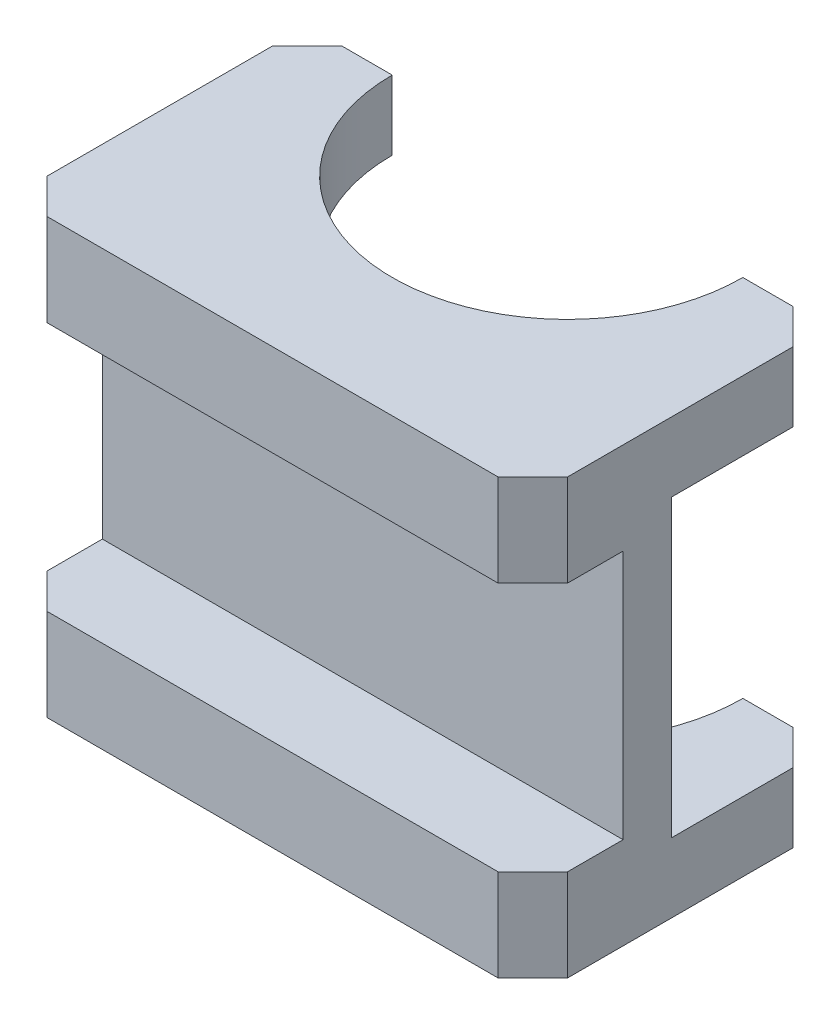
ISO-10303-21;
HEADER;
FILE_DESCRIPTION(('STEP AP214'),'2;1');
FILE_NAME('part.step','',(''),(''),'','','');
FILE_SCHEMA(('AUTOMOTIVE_DESIGN { 1 0 10303 214 1 1 1 1 }'));
ENDSEC;
DATA;
#1=APPLICATION_CONTEXT('core data for automotive mechanical design processes');
#2=APPLICATION_PROTOCOL_DEFINITION('international standard','automotive_design',2000,#1);
#3=PRODUCT_CONTEXT('',#1,'mechanical');
#4=PRODUCT('Part','Part','',(#3));
#5=PRODUCT_RELATED_PRODUCT_CATEGORY('part','',(#4));
#6=PRODUCT_DEFINITION_FORMATION('','',#4);
#7=PRODUCT_DEFINITION_CONTEXT('part definition',#1,'design');
#8=PRODUCT_DEFINITION('design','',#6,#7);
#9=PRODUCT_DEFINITION_SHAPE('','',#8);
#10=(LENGTH_UNIT() NAMED_UNIT(*) SI_UNIT(.MILLI.,.METRE.));
#11=(NAMED_UNIT(*) PLANE_ANGLE_UNIT() SI_UNIT($,.RADIAN.));
#12=(NAMED_UNIT(*) SI_UNIT($,.STERADIAN.) SOLID_ANGLE_UNIT());
#13=UNCERTAINTY_MEASURE_WITH_UNIT(LENGTH_MEASURE(1.E-05),#10,'distance_accuracy_value','');
#14=(GEOMETRIC_REPRESENTATION_CONTEXT(3) GLOBAL_UNCERTAINTY_ASSIGNED_CONTEXT((#13)) GLOBAL_UNIT_ASSIGNED_CONTEXT((#10,
#11,#12)) REPRESENTATION_CONTEXT('',''));
#15=CARTESIAN_POINT('',(0.,0.,0.));
#16=DIRECTION('',(0.,0.,1.));
#17=DIRECTION('',(1.,0.,0.));
#18=AXIS2_PLACEMENT_3D('',#15,#16,#17);
#19=CARTESIAN_POINT('',(31.877,31.75,-21.59));
#20=DIRECTION('',(0.,0.,1.));
#21=DIRECTION('',(1.,0.,0.));
#22=AXIS2_PLACEMENT_3D('',#19,#20,#21);
#23=PLANE('',#22);
#24=DIRECTION('',(1.,0.,0.));
#25=VECTOR('',#24,1.);
#26=CARTESIAN_POINT('',(0.,5.08,-21.59));
#27=LINE('',#26,#25);
#28=CARTESIAN_POINT('',(31.877,5.08,-21.59));
#29=VERTEX_POINT('',#28);
#30=CARTESIAN_POINT('',(35.56,5.08,-21.59));
#31=VERTEX_POINT('',#30);
#32=EDGE_CURVE('E247',#29,#31,#27,.T.);
#33=ORIENTED_EDGE('',*,*,#32,.T.);
#34=DIRECTION('',(0.,-1.,0.));
#35=VECTOR('',#34,1.);
#36=CARTESIAN_POINT('',(35.56,31.75,-21.59));
#37=LINE('',#36,#35);
#38=CARTESIAN_POINT('',(35.56,0.,-21.59));
#39=VERTEX_POINT('',#38);
#40=EDGE_CURVE('E394',#31,#39,#37,.T.);
#41=ORIENTED_EDGE('',*,*,#40,.T.);
#42=DIRECTION('',(-1.,0.,0.));
#43=VECTOR('',#42,1.);
#44=CARTESIAN_POINT('',(31.877,0.,-21.59));
#45=LINE('',#44,#43);
#46=CARTESIAN_POINT('',(31.877,0.,-21.59));
#47=VERTEX_POINT('',#46);
#48=EDGE_CURVE('E296',#39,#47,#45,.T.);
#49=ORIENTED_EDGE('',*,*,#48,.T.);
#50=DIRECTION('',(0.,-1.,0.));
#51=VECTOR('',#50,1.);
#52=CARTESIAN_POINT('',(31.877,31.75,-21.59));
#53=LINE('',#52,#51);
#54=EDGE_CURVE('E324',#29,#47,#53,.T.);
#55=ORIENTED_EDGE('',*,*,#54,.F.);
#56=EDGE_LOOP('',(#33,#41,#49,#55));
#57=FACE_BOUND('',#56,.T.);
#58=ADVANCED_FACE('F36',(#57),#23,.F.);
#59=CARTESIAN_POINT('',(0.,31.75,-21.59));
#60=DIRECTION('',(0.,0.,1.));
#61=DIRECTION('',(1.,0.,0.));
#62=AXIS2_PLACEMENT_3D('',#59,#60,#61);
#63=PLANE('',#62);
#64=DIRECTION('',(-1.,0.,0.));
#65=VECTOR('',#64,1.);
#66=CARTESIAN_POINT('',(0.,0.,-21.59));
#67=LINE('',#66,#65);
#68=CARTESIAN_POINT('',(6.223,0.,-21.59));
#69=VERTEX_POINT('',#68);
#70=CARTESIAN_POINT('',(2.54000000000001,0.,-21.59));
#71=VERTEX_POINT('',#70);
#72=EDGE_CURVE('E301',#69,#71,#67,.T.);
#73=ORIENTED_EDGE('',*,*,#72,.T.);
#74=DIRECTION('',(0.,1.,0.));
#75=VECTOR('',#74,1.);
#76=CARTESIAN_POINT('',(2.54000000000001,31.75,-21.59));
#77=LINE('',#76,#75);
#78=CARTESIAN_POINT('',(2.54000000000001,5.08,-21.59));
#79=VERTEX_POINT('',#78);
#80=EDGE_CURVE('E390',#71,#79,#77,.T.);
#81=ORIENTED_EDGE('',*,*,#80,.T.);
#82=CARTESIAN_POINT('',(6.223,5.08,-21.59));
#83=VERTEX_POINT('',#82);
#84=EDGE_CURVE('E244',#79,#83,#27,.T.);
#85=ORIENTED_EDGE('',*,*,#84,.T.);
#86=DIRECTION('',(0.,-1.,0.));
#87=VECTOR('',#86,1.);
#88=CARTESIAN_POINT('',(6.223,31.75,-21.59));
#89=LINE('',#88,#87);
#90=EDGE_CURVE('E320',#83,#69,#89,.T.);
#91=ORIENTED_EDGE('',*,*,#90,.T.);
#92=EDGE_LOOP('',(#73,#81,#85,#91));
#93=FACE_BOUND('',#92,.T.);
#94=ADVANCED_FACE('F469',(#93),#63,.F.);
#95=CARTESIAN_POINT('',(0.,31.75,0.));
#96=DIRECTION('',(0.,0.,-1.));
#97=DIRECTION('',(-1.,0.,0.));
#98=AXIS2_PLACEMENT_3D('',#95,#96,#97);
#99=PLANE('',#98);
#100=DIRECTION('',(1.,0.,0.));
#101=VECTOR('',#100,1.);
#102=CARTESIAN_POINT('',(0.,31.75,0.));
#103=LINE('',#102,#101);
#104=CARTESIAN_POINT('',(2.54,31.75,0.));
#105=VERTEX_POINT('',#104);
#106=CARTESIAN_POINT('',(35.56,31.75,0.));
#107=VERTEX_POINT('',#106);
#108=EDGE_CURVE('E307',#105,#107,#103,.T.);
#109=ORIENTED_EDGE('',*,*,#108,.F.);
#110=DIRECTION('',(0.,-1.,0.));
#111=VECTOR('',#110,1.);
#112=CARTESIAN_POINT('',(2.53999999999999,31.75,0.));
#113=LINE('',#112,#111);
#114=CARTESIAN_POINT('',(2.53999999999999,25.019,0.));
#115=VERTEX_POINT('',#114);
#116=EDGE_CURVE('E371',#105,#115,#113,.T.);
#117=ORIENTED_EDGE('',*,*,#116,.T.);
#118=DIRECTION('',(1.,0.,0.));
#119=VECTOR('',#118,1.);
#120=CARTESIAN_POINT('',(0.,25.019,0.));
#121=LINE('',#120,#119);
#122=CARTESIAN_POINT('',(35.56,25.019,0.));
#123=VERTEX_POINT('',#122);
#124=EDGE_CURVE('E277',#115,#123,#121,.T.);
#125=ORIENTED_EDGE('',*,*,#124,.T.);
#126=DIRECTION('',(0.,1.,0.));
#127=VECTOR('',#126,1.);
#128=CARTESIAN_POINT('',(35.56,31.75,0.));
#129=LINE('',#128,#127);
#130=EDGE_CURVE('E369',#123,#107,#129,.T.);
#131=ORIENTED_EDGE('',*,*,#130,.T.);
#132=EDGE_LOOP('',(#109,#117,#125,#131));
#133=FACE_BOUND('',#132,.T.);
#134=ADVANCED_FACE('F426',(#133),#99,.F.);
#135=CARTESIAN_POINT('',(0.,31.75,0.));
#136=DIRECTION('',(1.,0.,0.));
#137=DIRECTION('',(0.,0.,-1.));
#138=AXIS2_PLACEMENT_3D('',#135,#136,#137);
#139=PLANE('',#138);
#140=DIRECTION('',(0.,0.,1.));
#141=VECTOR('',#140,1.);
#142=CARTESIAN_POINT('',(0.,0.,0.));
#143=LINE('',#142,#141);
#144=CARTESIAN_POINT('',(0.,0.,-19.05));
#145=VERTEX_POINT('',#144);
#146=CARTESIAN_POINT('',(0.,0.,-2.53999999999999));
#147=VERTEX_POINT('',#146);
#148=EDGE_CURVE('E280',#145,#147,#143,.T.);
#149=ORIENTED_EDGE('',*,*,#148,.T.);
#150=DIRECTION('',(0.,1.,0.));
#151=VECTOR('',#150,1.);
#152=CARTESIAN_POINT('',(0.,31.75,-2.53999999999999));
#153=LINE('',#152,#151);
#154=CARTESIAN_POINT('',(0.,6.731,-2.53999999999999));
#155=VERTEX_POINT('',#154);
#156=EDGE_CURVE('E367',#147,#155,#153,.T.);
#157=ORIENTED_EDGE('',*,*,#156,.T.);
#158=DIRECTION('',(0.,0.,-1.));
#159=VECTOR('',#158,1.);
#160=CARTESIAN_POINT('',(0.,6.731,0.));
#161=LINE('',#160,#159);
#162=CARTESIAN_POINT('',(0.,6.731,-6.604));
#163=VERTEX_POINT('',#162);
#164=EDGE_CURVE('E268',#155,#163,#161,.T.);
#165=ORIENTED_EDGE('',*,*,#164,.T.);
#166=DIRECTION('',(0.,1.,0.));
#167=VECTOR('',#166,1.);
#168=CARTESIAN_POINT('',(0.,25.019,-6.60399999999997));
#169=LINE('',#168,#167);
#170=CARTESIAN_POINT('',(0.,25.019,-6.60399999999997));
#171=VERTEX_POINT('',#170);
#172=EDGE_CURVE('E270',#163,#171,#169,.T.);
#173=ORIENTED_EDGE('',*,*,#172,.T.);
#174=DIRECTION('',(0.,0.,1.));
#175=VECTOR('',#174,1.);
#176=CARTESIAN_POINT('',(0.,25.019,0.));
#177=LINE('',#176,#175);
#178=CARTESIAN_POINT('',(0.,25.019,-2.54000000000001));
#179=VERTEX_POINT('',#178);
#180=EDGE_CURVE('E273',#171,#179,#177,.T.);
#181=ORIENTED_EDGE('',*,*,#180,.T.);
#182=DIRECTION('',(0.,1.,0.));
#183=VECTOR('',#182,1.);
#184=CARTESIAN_POINT('',(0.,31.75,-2.54000000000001));
#185=LINE('',#184,#183);
#186=CARTESIAN_POINT('',(0.,31.75,-2.54000000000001));
#187=VERTEX_POINT('',#186);
#188=EDGE_CURVE('E365',#179,#187,#185,.T.);
#189=ORIENTED_EDGE('',*,*,#188,.T.);
#190=DIRECTION('',(0.,0.,1.));
#191=VECTOR('',#190,1.);
#192=CARTESIAN_POINT('',(0.,31.75,0.));
#193=LINE('',#192,#191);
#194=CARTESIAN_POINT('',(0.,31.75,-19.05));
#195=VERTEX_POINT('',#194);
#196=EDGE_CURVE('E304',#195,#187,#193,.T.);
#197=ORIENTED_EDGE('',*,*,#196,.F.);
#198=DIRECTION('',(0.,-1.,0.));
#199=VECTOR('',#198,1.);
#200=CARTESIAN_POINT('',(0.,31.75,-19.05));
#201=LINE('',#200,#199);
#202=CARTESIAN_POINT('',(0.,26.67,-19.05));
#203=VERTEX_POINT('',#202);
#204=EDGE_CURVE('E362',#195,#203,#201,.T.);
#205=ORIENTED_EDGE('',*,*,#204,.T.);
#206=DIRECTION('',(0.,0.,1.));
#207=VECTOR('',#206,1.);
#208=CARTESIAN_POINT('',(0.,26.67,-21.59));
#209=LINE('',#208,#207);
#210=CARTESIAN_POINT('',(0.,26.67,-10.1344380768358));
#211=VERTEX_POINT('',#210);
#212=EDGE_CURVE('E233',#203,#211,#209,.T.);
#213=ORIENTED_EDGE('',*,*,#212,.T.);
#214=DIRECTION('',(0.,-1.,0.));
#215=VECTOR('',#214,1.);
#216=CARTESIAN_POINT('',(0.,5.08,-10.1344380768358));
#217=LINE('',#216,#215);
#218=CARTESIAN_POINT('',(0.,5.08,-10.1344380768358));
#219=VERTEX_POINT('',#218);
#220=EDGE_CURVE('E237',#211,#219,#217,.T.);
#221=ORIENTED_EDGE('',*,*,#220,.T.);
#222=DIRECTION('',(0.,0.,-1.));
#223=VECTOR('',#222,1.);
#224=CARTESIAN_POINT('',(0.,5.08,-21.59));
#225=LINE('',#224,#223);
#226=CARTESIAN_POINT('',(0.,5.08,-19.05));
#227=VERTEX_POINT('',#226);
#228=EDGE_CURVE('E240',#219,#227,#225,.T.);
#229=ORIENTED_EDGE('',*,*,#228,.T.);
#230=DIRECTION('',(0.,-1.,0.));
#231=VECTOR('',#230,1.);
#232=CARTESIAN_POINT('',(0.,31.75,-19.05));
#233=LINE('',#232,#231);
#234=EDGE_CURVE('E359',#227,#145,#233,.T.);
#235=ORIENTED_EDGE('',*,*,#234,.T.);
#236=EDGE_LOOP('',(#149,#157,#165,#173,#181,#189,#197,#205,#213,#221,#229,#235));
#237=FACE_BOUND('',#236,.T.);
#238=ADVANCED_FACE('F38',(#237),#139,.F.);
#239=DIRECTION('',(1.,0.,0.));
#240=VECTOR('',#239,1.);
#241=CARTESIAN_POINT('',(0.,0.,0.));
#242=LINE('',#241,#240);
#243=CARTESIAN_POINT('',(2.54000000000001,0.,0.));
#244=VERTEX_POINT('',#243);
#245=CARTESIAN_POINT('',(35.56,0.,0.));
#246=VERTEX_POINT('',#245);
#247=EDGE_CURVE('E290',#244,#246,#242,.T.);
#248=ORIENTED_EDGE('',*,*,#247,.T.);
#249=DIRECTION('',(0.,1.,0.));
#250=VECTOR('',#249,1.);
#251=CARTESIAN_POINT('',(35.56,31.75,0.));
#252=LINE('',#251,#250);
#253=CARTESIAN_POINT('',(35.56,6.731,0.));
#254=VERTEX_POINT('',#253);
#255=EDGE_CURVE('E353',#246,#254,#252,.T.);
#256=ORIENTED_EDGE('',*,*,#255,.T.);
#257=DIRECTION('',(1.,0.,0.));
#258=VECTOR('',#257,1.);
#259=CARTESIAN_POINT('',(0.,6.731,0.));
#260=LINE('',#259,#258);
#261=CARTESIAN_POINT('',(2.54000000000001,6.731,0.));
#262=VERTEX_POINT('',#261);
#263=EDGE_CURVE('E276',#262,#254,#260,.T.);
#264=ORIENTED_EDGE('',*,*,#263,.F.);
#265=DIRECTION('',(0.,-1.,0.));
#266=VECTOR('',#265,1.);
#267=CARTESIAN_POINT('',(2.54000000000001,31.75,0.));
#268=LINE('',#267,#266);
#269=EDGE_CURVE('E350',#262,#244,#268,.T.);
#270=ORIENTED_EDGE('',*,*,#269,.T.);
#271=EDGE_LOOP('',(#248,#256,#264,#270));
#272=FACE_BOUND('',#271,.T.);
#273=ADVANCED_FACE('F452',(#272),#99,.F.);
#274=CARTESIAN_POINT('',(38.1,31.75,0.));
#275=DIRECTION('',(-1.,0.,0.));
#276=DIRECTION('',(0.,0.,1.));
#277=AXIS2_PLACEMENT_3D('',#274,#275,#276);
#278=PLANE('',#277);
#279=DIRECTION('',(0.,0.,-1.));
#280=VECTOR('',#279,1.);
#281=CARTESIAN_POINT('',(38.1,6.731,0.));
#282=LINE('',#281,#280);
#283=CARTESIAN_POINT('',(38.1,6.731,-2.54000000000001));
#284=VERTEX_POINT('',#283);
#285=CARTESIAN_POINT('',(38.1,6.731,-6.604));
#286=VERTEX_POINT('',#285);
#287=EDGE_CURVE('E260',#284,#286,#282,.T.);
#288=ORIENTED_EDGE('',*,*,#287,.F.);
#289=DIRECTION('',(0.,-1.,0.));
#290=VECTOR('',#289,1.);
#291=CARTESIAN_POINT('',(38.1,31.75,-2.54000000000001));
#292=LINE('',#291,#290);
#293=CARTESIAN_POINT('',(38.1,0.,-2.54000000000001));
#294=VERTEX_POINT('',#293);
#295=EDGE_CURVE('E339',#284,#294,#292,.T.);
#296=ORIENTED_EDGE('',*,*,#295,.T.);
#297=DIRECTION('',(0.,0.,-1.));
#298=VECTOR('',#297,1.);
#299=CARTESIAN_POINT('',(38.1,0.,0.));
#300=LINE('',#299,#298);
#301=CARTESIAN_POINT('',(38.1,0.,-19.05));
#302=VERTEX_POINT('',#301);
#303=EDGE_CURVE('E293',#294,#302,#300,.T.);
#304=ORIENTED_EDGE('',*,*,#303,.T.);
#305=DIRECTION('',(0.,1.,0.));
#306=VECTOR('',#305,1.);
#307=CARTESIAN_POINT('',(38.1,31.75,-19.05));
#308=LINE('',#307,#306);
#309=CARTESIAN_POINT('',(38.1,5.08,-19.05));
#310=VERTEX_POINT('',#309);
#311=EDGE_CURVE('E334',#302,#310,#308,.T.);
#312=ORIENTED_EDGE('',*,*,#311,.T.);
#313=DIRECTION('',(0.,0.,-1.));
#314=VECTOR('',#313,1.);
#315=CARTESIAN_POINT('',(38.1,5.08,-21.59));
#316=LINE('',#315,#314);
#317=CARTESIAN_POINT('',(38.1,5.08,-10.1344380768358));
#318=VERTEX_POINT('',#317);
#319=EDGE_CURVE('E231',#318,#310,#316,.T.);
#320=ORIENTED_EDGE('',*,*,#319,.F.);
#321=DIRECTION('',(0.,-1.,0.));
#322=VECTOR('',#321,1.);
#323=CARTESIAN_POINT('',(38.1,5.08,-10.1344380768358));
#324=LINE('',#323,#322);
#325=CARTESIAN_POINT('',(38.1,26.67,-10.1344380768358));
#326=VERTEX_POINT('',#325);
#327=EDGE_CURVE('E216',#326,#318,#324,.T.);
#328=ORIENTED_EDGE('',*,*,#327,.F.);
#329=DIRECTION('',(0.,0.,1.));
#330=VECTOR('',#329,1.);
#331=CARTESIAN_POINT('',(38.1,26.67,-21.59));
#332=LINE('',#331,#330);
#333=CARTESIAN_POINT('',(38.1,26.67,-19.05));
#334=VERTEX_POINT('',#333);
#335=EDGE_CURVE('E208',#334,#326,#332,.T.);
#336=ORIENTED_EDGE('',*,*,#335,.F.);
#337=DIRECTION('',(0.,1.,0.));
#338=VECTOR('',#337,1.);
#339=CARTESIAN_POINT('',(38.1,31.75,-19.05));
#340=LINE('',#339,#338);
#341=CARTESIAN_POINT('',(38.1,31.75,-19.05));
#342=VERTEX_POINT('',#341);
#343=EDGE_CURVE('E332',#334,#342,#340,.T.);
#344=ORIENTED_EDGE('',*,*,#343,.T.);
#345=DIRECTION('',(0.,0.,-1.));
#346=VECTOR('',#345,1.);
#347=CARTESIAN_POINT('',(38.1,31.75,0.));
#348=LINE('',#347,#346);
#349=CARTESIAN_POINT('',(38.1,31.75,-2.53999999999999));
#350=VERTEX_POINT('',#349);
#351=EDGE_CURVE('E310',#350,#342,#348,.T.);
#352=ORIENTED_EDGE('',*,*,#351,.F.);
#353=DIRECTION('',(0.,-1.,0.));
#354=VECTOR('',#353,1.);
#355=CARTESIAN_POINT('',(38.1,31.75,-2.53999999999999));
#356=LINE('',#355,#354);
#357=CARTESIAN_POINT('',(38.1,25.019,-2.53999999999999));
#358=VERTEX_POINT('',#357);
#359=EDGE_CURVE('E336',#350,#358,#356,.T.);
#360=ORIENTED_EDGE('',*,*,#359,.T.);
#361=DIRECTION('',(0.,0.,1.));
#362=VECTOR('',#361,1.);
#363=CARTESIAN_POINT('',(38.1,25.019,0.));
#364=LINE('',#363,#362);
#365=CARTESIAN_POINT('',(38.1,25.019,-6.60399999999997));
#366=VERTEX_POINT('',#365);
#367=EDGE_CURVE('E265',#366,#358,#364,.T.);
#368=ORIENTED_EDGE('',*,*,#367,.F.);
#369=DIRECTION('',(0.,1.,0.));
#370=VECTOR('',#369,1.);
#371=CARTESIAN_POINT('',(38.1,25.019,-6.60399999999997));
#372=LINE('',#371,#370);
#373=EDGE_CURVE('E262',#286,#366,#372,.T.);
#374=ORIENTED_EDGE('',*,*,#373,.F.);
#375=EDGE_LOOP('',(#288,#296,#304,#312,#320,#328,#336,#344,#352,#360,#368,#374));
#376=FACE_BOUND('',#375,.T.);
#377=ADVANCED_FACE('F230',(#376),#278,.F.);
#378=DIRECTION('',(-1.,0.,0.));
#379=VECTOR('',#378,1.);
#380=CARTESIAN_POINT('',(31.877,31.75,-21.59));
#381=LINE('',#380,#379);
#382=CARTESIAN_POINT('',(35.56,31.75,-21.59));
#383=VERTEX_POINT('',#382);
#384=CARTESIAN_POINT('',(31.877,31.75,-21.59));
#385=VERTEX_POINT('',#384);
#386=EDGE_CURVE('E313',#383,#385,#381,.T.);
#387=ORIENTED_EDGE('',*,*,#386,.F.);
#388=DIRECTION('',(0.,-1.,0.));
#389=VECTOR('',#388,1.);
#390=CARTESIAN_POINT('',(35.56,31.75,-21.59));
#391=LINE('',#390,#389);
#392=CARTESIAN_POINT('',(35.56,26.67,-21.59));
#393=VERTEX_POINT('',#392);
#394=EDGE_CURVE('E44',#383,#393,#391,.T.);
#395=ORIENTED_EDGE('',*,*,#394,.T.);
#396=DIRECTION('',(1.,0.,0.));
#397=VECTOR('',#396,1.);
#398=CARTESIAN_POINT('',(0.,26.67,-21.59));
#399=LINE('',#398,#397);
#400=CARTESIAN_POINT('',(31.877,26.67,-21.59));
#401=VERTEX_POINT('',#400);
#402=EDGE_CURVE('E243',#401,#393,#399,.T.);
#403=ORIENTED_EDGE('',*,*,#402,.F.);
#404=EDGE_CURVE('E325',#385,#401,#53,.T.);
#405=ORIENTED_EDGE('',*,*,#404,.F.);
#406=EDGE_LOOP('',(#387,#395,#403,#405));
#407=FACE_BOUND('',#406,.T.);
#408=ADVANCED_FACE('F400',(#407),#23,.F.);
#409=CARTESIAN_POINT('',(19.05,31.75,-21.59));
#410=DIRECTION('',(0.,-1.,0.));
#411=DIRECTION('',(0.,0.,-1.));
#412=AXIS2_PLACEMENT_3D('',#409,#410,#411);
#413=CYLINDRICAL_SURFACE('',#412,12.827);
#414=ORIENTED_EDGE('',*,*,#90,.F.);
#415=CARTESIAN_POINT('',(19.05,5.08,-21.59));
#416=DIRECTION('',(0.,-1.,0.));
#417=DIRECTION('',(0.,0.,-1.));
#418=AXIS2_PLACEMENT_3D('',#415,#416,#417);
#419=CIRCLE('',#418,12.827);
#420=CARTESIAN_POINT('',(13.2792088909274,5.08,-10.1344380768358));
#421=VERTEX_POINT('',#420);
#422=EDGE_CURVE('E259',#83,#421,#419,.F.);
#423=ORIENTED_EDGE('',*,*,#422,.T.);
#424=DIRECTION('',(0.,-1.,0.));
#425=VECTOR('',#424,1.);
#426=CARTESIAN_POINT('',(13.2792088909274,31.75,-10.1344380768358));
#427=LINE('',#426,#425);
#428=CARTESIAN_POINT('',(13.2792088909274,26.67,-10.1344380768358));
#429=VERTEX_POINT('',#428);
#430=EDGE_CURVE('E329',#421,#429,#427,.F.);
#431=ORIENTED_EDGE('',*,*,#430,.T.);
#432=CARTESIAN_POINT('',(19.05,26.67,-21.59));
#433=DIRECTION('',(0.,1.,0.));
#434=DIRECTION('',(0.,0.,1.));
#435=AXIS2_PLACEMENT_3D('',#432,#433,#434);
#436=CIRCLE('',#435,12.827);
#437=CARTESIAN_POINT('',(6.223,26.67,-21.59));
#438=VERTEX_POINT('',#437);
#439=EDGE_CURVE('E255',#429,#438,#436,.F.);
#440=ORIENTED_EDGE('',*,*,#439,.T.);
#441=CARTESIAN_POINT('',(6.223,31.75,-21.59));
#442=VERTEX_POINT('',#441);
#443=EDGE_CURVE('E321',#442,#438,#89,.T.);
#444=ORIENTED_EDGE('',*,*,#443,.F.);
#445=CARTESIAN_POINT('',(19.05,31.75,-21.59));
#446=DIRECTION('',(0.,-1.,0.));
#447=DIRECTION('',(0.,0.,1.));
#448=AXIS2_PLACEMENT_3D('',#445,#446,#447);
#449=CIRCLE('',#448,12.827);
#450=EDGE_CURVE('E315',#385,#442,#449,.T.);
#451=ORIENTED_EDGE('',*,*,#450,.F.);
#452=ORIENTED_EDGE('',*,*,#404,.T.);
#453=CARTESIAN_POINT('',(24.8207911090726,26.67,-10.1344380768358));
#454=VERTEX_POINT('',#453);
#455=EDGE_CURVE('E246',#401,#454,#436,.F.);
#456=ORIENTED_EDGE('',*,*,#455,.T.);
#457=DIRECTION('',(0.,-1.,0.));
#458=VECTOR('',#457,1.);
#459=CARTESIAN_POINT('',(24.8207911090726,31.75,-10.1344380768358));
#460=LINE('',#459,#458);
#461=CARTESIAN_POINT('',(24.8207911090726,5.08,-10.1344380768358));
#462=VERTEX_POINT('',#461);
#463=EDGE_CURVE('E224',#454,#462,#460,.T.);
#464=ORIENTED_EDGE('',*,*,#463,.T.);
#465=EDGE_CURVE('E256',#462,#29,#419,.F.);
#466=ORIENTED_EDGE('',*,*,#465,.T.);
#467=ORIENTED_EDGE('',*,*,#54,.T.);
#468=CARTESIAN_POINT('',(19.05,0.,-21.59));
#469=DIRECTION('',(0.,-1.,0.));
#470=DIRECTION('',(0.,0.,1.));
#471=AXIS2_PLACEMENT_3D('',#468,#469,#470);
#472=CIRCLE('',#471,12.827);
#473=EDGE_CURVE('E298',#47,#69,#472,.T.);
#474=ORIENTED_EDGE('',*,*,#473,.T.);
#475=EDGE_LOOP('',(#414,#423,#431,#440,#444,#451,#452,#456,#464,#466,#467,#474));
#476=FACE_BOUND('',#475,.T.);
#477=ADVANCED_FACE('F405',(#476),#413,.F.);
#478=CARTESIAN_POINT('',(2.54000000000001,26.67,-21.59));
#479=VERTEX_POINT('',#478);
#480=EDGE_CURVE('E227',#479,#438,#399,.T.);
#481=ORIENTED_EDGE('',*,*,#480,.F.);
#482=DIRECTION('',(0.,1.,0.));
#483=VECTOR('',#482,1.);
#484=CARTESIAN_POINT('',(2.54000000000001,31.75,-21.59));
#485=LINE('',#484,#483);
#486=CARTESIAN_POINT('',(2.54,31.75,-21.59));
#487=VERTEX_POINT('',#486);
#488=EDGE_CURVE('E388',#479,#487,#485,.T.);
#489=ORIENTED_EDGE('',*,*,#488,.T.);
#490=DIRECTION('',(-1.,0.,0.));
#491=VECTOR('',#490,1.);
#492=CARTESIAN_POINT('',(0.,31.75,-21.59));
#493=LINE('',#492,#491);
#494=EDGE_CURVE('E317',#442,#487,#493,.T.);
#495=ORIENTED_EDGE('',*,*,#494,.F.);
#496=ORIENTED_EDGE('',*,*,#443,.T.);
#497=EDGE_LOOP('',(#481,#489,#495,#496));
#498=FACE_BOUND('',#497,.T.);
#499=ADVANCED_FACE('F502',(#498),#63,.F.);
#500=CARTESIAN_POINT('',(19.05,31.75,-21.59));
#501=DIRECTION('',(0.,1.,0.));
#502=DIRECTION('',(0.,0.,1.));
#503=AXIS2_PLACEMENT_3D('',#500,#501,#502);
#504=PLANE('',#503);
#505=ORIENTED_EDGE('',*,*,#196,.T.);
#506=DIRECTION('',(-0.707106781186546,0.,-0.707106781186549));
#507=VECTOR('',#506,1.);
#508=CARTESIAN_POINT('',(0.,31.75,-2.54000000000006));
#509=LINE('',#508,#507);
#510=EDGE_CURVE('E384',#187,#105,#509,.F.);
#511=ORIENTED_EDGE('',*,*,#510,.T.);
#512=ORIENTED_EDGE('',*,*,#108,.T.);
#513=DIRECTION('',(-0.707106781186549,0.,0.707106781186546));
#514=VECTOR('',#513,1.);
#515=CARTESIAN_POINT('',(38.1,31.75,-2.53999999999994));
#516=LINE('',#515,#514);
#517=EDGE_CURVE('E382',#107,#350,#516,.F.);
#518=ORIENTED_EDGE('',*,*,#517,.T.);
#519=ORIENTED_EDGE('',*,*,#351,.T.);
#520=DIRECTION('',(0.707106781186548,0.,0.707106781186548));
#521=VECTOR('',#520,1.);
#522=CARTESIAN_POINT('',(27.305,31.75,-29.845));
#523=LINE('',#522,#521);
#524=EDGE_CURVE('E378',#342,#383,#523,.F.);
#525=ORIENTED_EDGE('',*,*,#524,.T.);
#526=ORIENTED_EDGE('',*,*,#386,.T.);
#527=ORIENTED_EDGE('',*,*,#450,.T.);
#528=ORIENTED_EDGE('',*,*,#494,.T.);
#529=DIRECTION('',(0.70710678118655,0.,-0.707106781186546));
#530=VECTOR('',#529,1.);
#531=CARTESIAN_POINT('',(10.7950000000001,31.75,-29.845));
#532=LINE('',#531,#530);
#533=EDGE_CURVE('E380',#487,#195,#532,.F.);
#534=ORIENTED_EDGE('',*,*,#533,.T.);
#535=EDGE_LOOP('',(#505,#511,#512,#518,#519,#525,#526,#527,#528,#534));
#536=FACE_BOUND('',#535,.T.);
#537=ADVANCED_FACE('F411',(#536),#504,.T.);
#538=CARTESIAN_POINT('',(19.05,0.,-21.59));
#539=DIRECTION('',(0.,1.,0.));
#540=DIRECTION('',(0.,0.,1.));
#541=AXIS2_PLACEMENT_3D('',#538,#539,#540);
#542=PLANE('',#541);
#543=ORIENTED_EDGE('',*,*,#303,.F.);
#544=DIRECTION('',(0.707106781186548,0.,-0.707106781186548));
#545=VECTOR('',#544,1.);
#546=CARTESIAN_POINT('',(38.1,0.,-2.54000000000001));
#547=LINE('',#546,#545);
#548=EDGE_CURVE('E348',#294,#246,#547,.F.);
#549=ORIENTED_EDGE('',*,*,#548,.T.);
#550=ORIENTED_EDGE('',*,*,#247,.F.);
#551=DIRECTION('',(0.707106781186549,0.,0.707106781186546));
#552=VECTOR('',#551,1.);
#553=CARTESIAN_POINT('',(2.54000000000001,0.,0.));
#554=LINE('',#553,#552);
#555=EDGE_CURVE('E346',#244,#147,#554,.F.);
#556=ORIENTED_EDGE('',*,*,#555,.T.);
#557=ORIENTED_EDGE('',*,*,#148,.F.);
#558=DIRECTION('',(-0.70710678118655,0.,0.707106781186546));
#559=VECTOR('',#558,1.);
#560=CARTESIAN_POINT('',(0.,0.,-19.05));
#561=LINE('',#560,#559);
#562=EDGE_CURVE('E344',#145,#71,#561,.F.);
#563=ORIENTED_EDGE('',*,*,#562,.T.);
#564=ORIENTED_EDGE('',*,*,#72,.F.);
#565=ORIENTED_EDGE('',*,*,#473,.F.);
#566=ORIENTED_EDGE('',*,*,#48,.F.);
#567=DIRECTION('',(-0.707106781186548,0.,-0.707106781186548));
#568=VECTOR('',#567,1.);
#569=CARTESIAN_POINT('',(35.56,0.,-21.59));
#570=LINE('',#569,#568);
#571=EDGE_CURVE('E342',#39,#302,#570,.F.);
#572=ORIENTED_EDGE('',*,*,#571,.T.);
#573=EDGE_LOOP('',(#543,#549,#550,#556,#557,#563,#564,#565,#566,#572));
#574=FACE_BOUND('',#573,.T.);
#575=ADVANCED_FACE('F450',(#574),#542,.F.);
#576=CARTESIAN_POINT('',(0.,25.019,0.));
#577=DIRECTION('',(0.,1.,0.));
#578=DIRECTION('',(0.,0.,1.));
#579=AXIS2_PLACEMENT_3D('',#576,#577,#578);
#580=PLANE('',#579);
#581=ORIENTED_EDGE('',*,*,#124,.F.);
#582=DIRECTION('',(0.707106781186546,0.,0.707106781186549));
#583=VECTOR('',#582,1.);
#584=CARTESIAN_POINT('',(2.53999999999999,25.019,0.));
#585=LINE('',#584,#583);
#586=EDGE_CURVE('E376',#115,#179,#585,.F.);
#587=ORIENTED_EDGE('',*,*,#586,.T.);
#588=ORIENTED_EDGE('',*,*,#180,.F.);
#589=DIRECTION('',(1.,0.,0.));
#590=VECTOR('',#589,1.);
#591=CARTESIAN_POINT('',(0.,25.019,-6.60399999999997));
#592=LINE('',#591,#590);
#593=EDGE_CURVE('E281',#171,#366,#592,.T.);
#594=ORIENTED_EDGE('',*,*,#593,.T.);
#595=ORIENTED_EDGE('',*,*,#367,.T.);
#596=DIRECTION('',(0.707106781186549,0.,-0.707106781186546));
#597=VECTOR('',#596,1.);
#598=CARTESIAN_POINT('',(38.1,25.019,-2.54));
#599=LINE('',#598,#597);
#600=EDGE_CURVE('E374',#358,#123,#599,.F.);
#601=ORIENTED_EDGE('',*,*,#600,.T.);
#602=EDGE_LOOP('',(#581,#587,#588,#594,#595,#601));
#603=FACE_BOUND('',#602,.T.);
#604=ADVANCED_FACE('F423',(#603),#580,.F.);
#605=CARTESIAN_POINT('',(0.,25.019,-6.60399999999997));
#606=DIRECTION('',(0.,0.,-1.));
#607=DIRECTION('',(0.,1.,0.));
#608=AXIS2_PLACEMENT_3D('',#605,#606,#607);
#609=PLANE('',#608);
#610=ORIENTED_EDGE('',*,*,#373,.T.);
#611=ORIENTED_EDGE('',*,*,#593,.F.);
#612=ORIENTED_EDGE('',*,*,#172,.F.);
#613=DIRECTION('',(1.,0.,0.));
#614=VECTOR('',#613,1.);
#615=CARTESIAN_POINT('',(0.,6.731,-6.604));
#616=LINE('',#615,#614);
#617=EDGE_CURVE('E283',#163,#286,#616,.T.);
#618=ORIENTED_EDGE('',*,*,#617,.T.);
#619=EDGE_LOOP('',(#610,#611,#612,#618));
#620=FACE_BOUND('',#619,.T.);
#621=ADVANCED_FACE('F439',(#620),#609,.F.);
#622=CARTESIAN_POINT('',(0.,6.731,0.));
#623=DIRECTION('',(0.,-1.,0.));
#624=DIRECTION('',(0.,0.,-1.));
#625=AXIS2_PLACEMENT_3D('',#622,#623,#624);
#626=PLANE('',#625);
#627=ORIENTED_EDGE('',*,*,#263,.T.);
#628=DIRECTION('',(-0.707106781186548,0.,0.707106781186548));
#629=VECTOR('',#628,1.);
#630=CARTESIAN_POINT('',(38.1,6.731,-2.54000000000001));
#631=LINE('',#630,#629);
#632=EDGE_CURVE('E357',#254,#284,#631,.F.);
#633=ORIENTED_EDGE('',*,*,#632,.T.);
#634=ORIENTED_EDGE('',*,*,#287,.T.);
#635=ORIENTED_EDGE('',*,*,#617,.F.);
#636=ORIENTED_EDGE('',*,*,#164,.F.);
#637=DIRECTION('',(-0.707106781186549,0.,-0.707106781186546));
#638=VECTOR('',#637,1.);
#639=CARTESIAN_POINT('',(2.54000000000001,6.731,0.));
#640=LINE('',#639,#638);
#641=EDGE_CURVE('E355',#155,#262,#640,.F.);
#642=ORIENTED_EDGE('',*,*,#641,.T.);
#643=EDGE_LOOP('',(#627,#633,#634,#635,#636,#642));
#644=FACE_BOUND('',#643,.T.);
#645=ADVANCED_FACE('F578',(#644),#626,.F.);
#646=CARTESIAN_POINT('',(0.,26.67,-21.59));
#647=DIRECTION('',(0.,1.,0.));
#648=DIRECTION('',(0.,0.,1.));
#649=AXIS2_PLACEMENT_3D('',#646,#647,#648);
#650=PLANE('',#649);
#651=ORIENTED_EDGE('',*,*,#212,.F.);
#652=DIRECTION('',(-0.70710678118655,0.,0.707106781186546));
#653=VECTOR('',#652,1.);
#654=CARTESIAN_POINT('',(0.,26.67,-19.05));
#655=LINE('',#654,#653);
#656=EDGE_CURVE('E386',#203,#479,#655,.F.);
#657=ORIENTED_EDGE('',*,*,#656,.T.);
#658=ORIENTED_EDGE('',*,*,#480,.T.);
#659=ORIENTED_EDGE('',*,*,#439,.F.);
#660=DIRECTION('',(1.,0.,0.));
#661=VECTOR('',#660,1.);
#662=CARTESIAN_POINT('',(0.,26.67,-10.1344380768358));
#663=LINE('',#662,#661);
#664=EDGE_CURVE('E226',#211,#429,#663,.T.);
#665=ORIENTED_EDGE('',*,*,#664,.F.);
#666=EDGE_LOOP('',(#651,#657,#658,#659,#665));
#667=FACE_BOUND('',#666,.T.);
#668=ADVANCED_FACE('F490',(#667),#650,.F.);
#669=CARTESIAN_POINT('',(0.,5.08,-21.59));
#670=DIRECTION('',(0.,-1.,0.));
#671=DIRECTION('',(0.,0.,-1.));
#672=AXIS2_PLACEMENT_3D('',#669,#670,#671);
#673=PLANE('',#672);
#674=ORIENTED_EDGE('',*,*,#84,.F.);
#675=DIRECTION('',(0.707106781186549,0.,-0.707106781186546));
#676=VECTOR('',#675,1.);
#677=CARTESIAN_POINT('',(0.,5.08,-19.05));
#678=LINE('',#677,#676);
#679=EDGE_CURVE('E392',#79,#227,#678,.F.);
#680=ORIENTED_EDGE('',*,*,#679,.T.);
#681=ORIENTED_EDGE('',*,*,#228,.F.);
#682=DIRECTION('',(1.,0.,0.));
#683=VECTOR('',#682,1.);
#684=CARTESIAN_POINT('',(0.,5.08,-10.1344380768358));
#685=LINE('',#684,#683);
#686=EDGE_CURVE('E248',#219,#421,#685,.T.);
#687=ORIENTED_EDGE('',*,*,#686,.T.);
#688=ORIENTED_EDGE('',*,*,#422,.F.);
#689=EDGE_LOOP('',(#674,#680,#681,#687,#688));
#690=FACE_BOUND('',#689,.T.);
#691=ADVANCED_FACE('F484',(#690),#673,.F.);
#692=CARTESIAN_POINT('',(0.,5.08,-10.1344380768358));
#693=DIRECTION('',(0.,0.,1.));
#694=DIRECTION('',(0.,-1.,0.));
#695=AXIS2_PLACEMENT_3D('',#692,#693,#694);
#696=PLANE('',#695);
#697=ORIENTED_EDGE('',*,*,#686,.F.);
#698=ORIENTED_EDGE('',*,*,#220,.F.);
#699=ORIENTED_EDGE('',*,*,#664,.T.);
#700=ORIENTED_EDGE('',*,*,#430,.F.);
#701=EDGE_LOOP('',(#697,#698,#699,#700));
#702=FACE_BOUND('',#701,.T.);
#703=ADVANCED_FACE('F491',(#702),#696,.F.);
#704=EDGE_CURVE('E212',#454,#326,#663,.T.);
#705=ORIENTED_EDGE('',*,*,#704,.T.);
#706=ORIENTED_EDGE('',*,*,#327,.T.);
#707=EDGE_CURVE('E250',#462,#318,#685,.T.);
#708=ORIENTED_EDGE('',*,*,#707,.F.);
#709=ORIENTED_EDGE('',*,*,#463,.F.);
#710=EDGE_LOOP('',(#705,#706,#708,#709));
#711=FACE_BOUND('',#710,.T.);
#712=ADVANCED_FACE('F220',(#711),#696,.F.);
#713=ORIENTED_EDGE('',*,*,#319,.T.);
#714=DIRECTION('',(0.707106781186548,0.,0.707106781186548));
#715=VECTOR('',#714,1.);
#716=CARTESIAN_POINT('',(35.56,5.08,-21.59));
#717=LINE('',#716,#715);
#718=EDGE_CURVE('E57',#310,#31,#717,.F.);
#719=ORIENTED_EDGE('',*,*,#718,.T.);
#720=ORIENTED_EDGE('',*,*,#32,.F.);
#721=ORIENTED_EDGE('',*,*,#465,.F.);
#722=ORIENTED_EDGE('',*,*,#707,.T.);
#723=EDGE_LOOP('',(#713,#719,#720,#721,#722));
#724=FACE_BOUND('',#723,.T.);
#725=ADVANCED_FACE('F481',(#724),#673,.F.);
#726=ORIENTED_EDGE('',*,*,#402,.T.);
#727=DIRECTION('',(-0.707106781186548,0.,-0.707106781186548));
#728=VECTOR('',#727,1.);
#729=CARTESIAN_POINT('',(35.56,26.67,-21.59));
#730=LINE('',#729,#728);
#731=EDGE_CURVE('E12',#393,#334,#730,.F.);
#732=ORIENTED_EDGE('',*,*,#731,.T.);
#733=ORIENTED_EDGE('',*,*,#335,.T.);
#734=ORIENTED_EDGE('',*,*,#704,.F.);
#735=ORIENTED_EDGE('',*,*,#455,.F.);
#736=EDGE_LOOP('',(#726,#732,#733,#734,#735));
#737=FACE_BOUND('',#736,.T.);
#738=ADVANCED_FACE('F211',(#737),#650,.F.);
#739=CARTESIAN_POINT('',(38.1,31.75,-2.54000000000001));
#740=DIRECTION('',(-0.707106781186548,0.,-0.707106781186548));
#741=DIRECTION('',(-0.707106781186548,0.,0.707106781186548));
#742=AXIS2_PLACEMENT_3D('',#739,#740,#741);
#743=PLANE('',#742);
#744=ORIENTED_EDGE('',*,*,#632,.F.);
#745=ORIENTED_EDGE('',*,*,#255,.F.);
#746=ORIENTED_EDGE('',*,*,#548,.F.);
#747=ORIENTED_EDGE('',*,*,#295,.F.);
#748=EDGE_LOOP('',(#744,#745,#746,#747));
#749=FACE_BOUND('',#748,.T.);
#750=ADVANCED_FACE('F446',(#749),#743,.F.);
#751=CARTESIAN_POINT('',(2.54000000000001,31.75,0.));
#752=DIRECTION('',(0.707106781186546,0.,-0.707106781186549));
#753=DIRECTION('',(-0.707106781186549,0.,-0.707106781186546));
#754=AXIS2_PLACEMENT_3D('',#751,#752,#753);
#755=PLANE('',#754);
#756=ORIENTED_EDGE('',*,*,#641,.F.);
#757=ORIENTED_EDGE('',*,*,#156,.F.);
#758=ORIENTED_EDGE('',*,*,#555,.F.);
#759=ORIENTED_EDGE('',*,*,#269,.F.);
#760=EDGE_LOOP('',(#756,#757,#758,#759));
#761=FACE_BOUND('',#760,.T.);
#762=ADVANCED_FACE('F457',(#761),#755,.F.);
#763=CARTESIAN_POINT('',(2.53999999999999,31.75,0.));
#764=DIRECTION('',(0.707106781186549,0.,-0.707106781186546));
#765=DIRECTION('',(-0.707106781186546,0.,-0.707106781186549));
#766=AXIS2_PLACEMENT_3D('',#763,#764,#765);
#767=PLANE('',#766);
#768=ORIENTED_EDGE('',*,*,#510,.F.);
#769=ORIENTED_EDGE('',*,*,#188,.F.);
#770=ORIENTED_EDGE('',*,*,#586,.F.);
#771=ORIENTED_EDGE('',*,*,#116,.F.);
#772=EDGE_LOOP('',(#768,#769,#770,#771));
#773=FACE_BOUND('',#772,.T.);
#774=ADVANCED_FACE('F430',(#773),#767,.F.);
#775=CARTESIAN_POINT('',(38.1,31.75,-2.53999999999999));
#776=DIRECTION('',(-0.707106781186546,0.,-0.707106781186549));
#777=DIRECTION('',(-0.707106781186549,0.,0.707106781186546));
#778=AXIS2_PLACEMENT_3D('',#775,#776,#777);
#779=PLANE('',#778);
#780=ORIENTED_EDGE('',*,*,#517,.F.);
#781=ORIENTED_EDGE('',*,*,#130,.F.);
#782=ORIENTED_EDGE('',*,*,#600,.F.);
#783=ORIENTED_EDGE('',*,*,#359,.F.);
#784=EDGE_LOOP('',(#780,#781,#782,#783));
#785=FACE_BOUND('',#784,.T.);
#786=ADVANCED_FACE('F419',(#785),#779,.F.);
#787=CARTESIAN_POINT('',(0.,31.75,-19.05));
#788=DIRECTION('',(0.707106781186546,0.,0.70710678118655));
#789=DIRECTION('',(0.70710678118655,0.,-0.707106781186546));
#790=AXIS2_PLACEMENT_3D('',#787,#788,#789);
#791=PLANE('',#790);
#792=ORIENTED_EDGE('',*,*,#533,.F.);
#793=ORIENTED_EDGE('',*,*,#488,.F.);
#794=ORIENTED_EDGE('',*,*,#656,.F.);
#795=ORIENTED_EDGE('',*,*,#204,.F.);
#796=EDGE_LOOP('',(#792,#793,#794,#795));
#797=FACE_BOUND('',#796,.T.);
#798=ADVANCED_FACE('F641',(#797),#791,.F.);
#799=CARTESIAN_POINT('',(0.,31.75,-19.05));
#800=DIRECTION('',(0.707106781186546,0.,0.70710678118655));
#801=DIRECTION('',(0.70710678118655,0.,-0.707106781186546));
#802=AXIS2_PLACEMENT_3D('',#799,#800,#801);
#803=PLANE('',#802);
#804=ORIENTED_EDGE('',*,*,#679,.F.);
#805=ORIENTED_EDGE('',*,*,#80,.F.);
#806=ORIENTED_EDGE('',*,*,#562,.F.);
#807=ORIENTED_EDGE('',*,*,#234,.F.);
#808=EDGE_LOOP('',(#804,#805,#806,#807));
#809=FACE_BOUND('',#808,.T.);
#810=ADVANCED_FACE('F464',(#809),#803,.F.);
#811=CARTESIAN_POINT('',(35.56,31.75,-21.59));
#812=DIRECTION('',(-0.707106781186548,0.,0.707106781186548));
#813=DIRECTION('',(0.707106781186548,0.,0.707106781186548));
#814=AXIS2_PLACEMENT_3D('',#811,#812,#813);
#815=PLANE('',#814);
#816=ORIENTED_EDGE('',*,*,#718,.F.);
#817=ORIENTED_EDGE('',*,*,#311,.F.);
#818=ORIENTED_EDGE('',*,*,#571,.F.);
#819=ORIENTED_EDGE('',*,*,#40,.F.);
#820=EDGE_LOOP('',(#816,#817,#818,#819));
#821=FACE_BOUND('',#820,.T.);
#822=ADVANCED_FACE('F479',(#821),#815,.F.);
#823=CARTESIAN_POINT('',(35.56,31.75,-21.59));
#824=DIRECTION('',(-0.707106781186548,0.,0.707106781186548));
#825=DIRECTION('',(0.707106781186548,0.,0.707106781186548));
#826=AXIS2_PLACEMENT_3D('',#823,#824,#825);
#827=PLANE('',#826);
#828=ORIENTED_EDGE('',*,*,#524,.F.);
#829=ORIENTED_EDGE('',*,*,#343,.F.);
#830=ORIENTED_EDGE('',*,*,#731,.F.);
#831=ORIENTED_EDGE('',*,*,#394,.F.);
#832=EDGE_LOOP('',(#828,#829,#830,#831));
#833=FACE_BOUND('',#832,.T.);
#834=ADVANCED_FACE('F414',(#833),#827,.F.);
#835=CLOSED_SHELL('',(#58,#94,#134,#238,#273,#377,#408,#477,#499,#537,#575,#604,#621,#645,#668,
#691,#703,#712,#725,#738,#750,#762,#774,#786,#798,#810,#822,#834));
#836=MANIFOLD_SOLID_BREP('B2',#835);
#837=ADVANCED_BREP_SHAPE_REPRESENTATION('',(#18,#836),#14);
#838=SHAPE_DEFINITION_REPRESENTATION(#9,#837);
ENDSEC;
END-ISO-10303-21;
